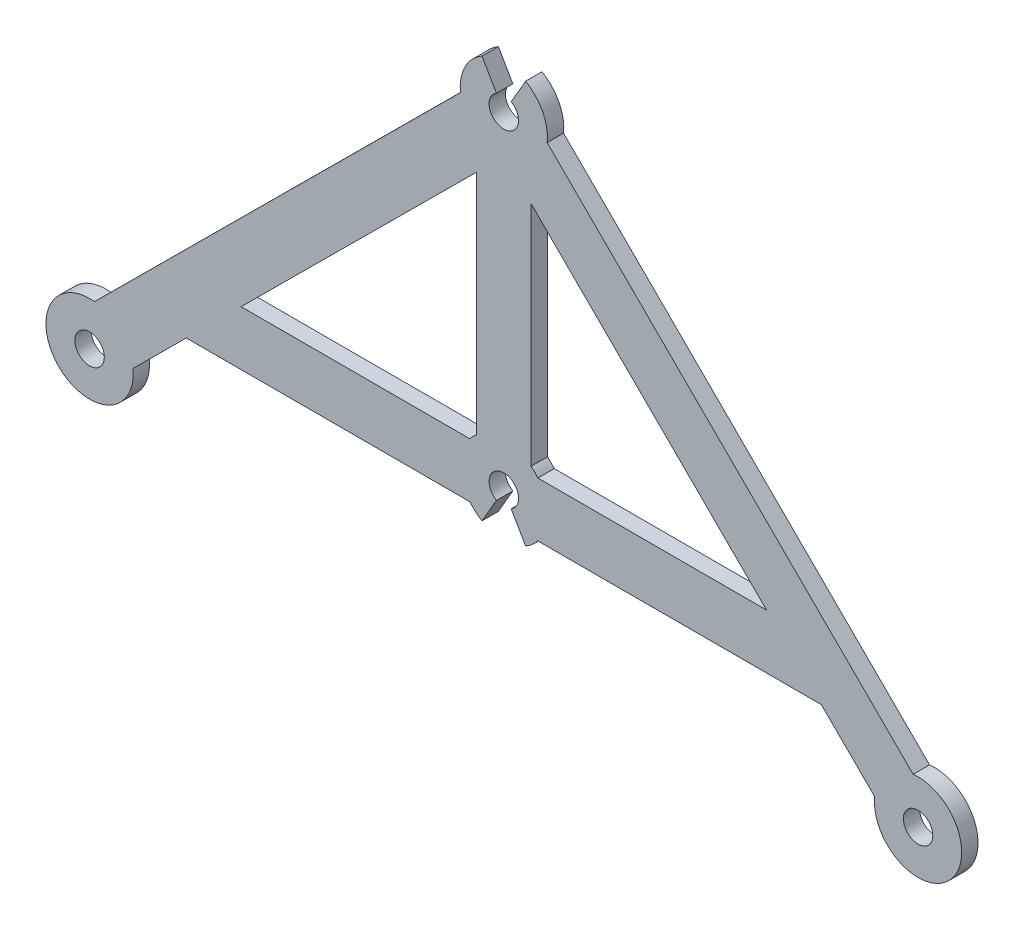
ISO-10303-21;
HEADER;
FILE_DESCRIPTION(('STEP AP214'),'2;1');
FILE_NAME('part.step','',(''),(''),'','','');
FILE_SCHEMA(('AUTOMOTIVE_DESIGN { 1 0 10303 214 1 1 1 1 }'));
ENDSEC;
DATA;
#1=APPLICATION_CONTEXT('core data for automotive mechanical design processes');
#2=APPLICATION_PROTOCOL_DEFINITION('international standard','automotive_design',2000,#1);
#3=PRODUCT_CONTEXT('',#1,'mechanical');
#4=PRODUCT('Part','Part','',(#3));
#5=PRODUCT_RELATED_PRODUCT_CATEGORY('part','',(#4));
#6=PRODUCT_DEFINITION_FORMATION('','',#4);
#7=PRODUCT_DEFINITION_CONTEXT('part definition',#1,'design');
#8=PRODUCT_DEFINITION('design','',#6,#7);
#9=PRODUCT_DEFINITION_SHAPE('','',#8);
#10=(LENGTH_UNIT() NAMED_UNIT(*) SI_UNIT(.MILLI.,.METRE.));
#11=(NAMED_UNIT(*) PLANE_ANGLE_UNIT() SI_UNIT($,.RADIAN.));
#12=(NAMED_UNIT(*) SI_UNIT($,.STERADIAN.) SOLID_ANGLE_UNIT());
#13=UNCERTAINTY_MEASURE_WITH_UNIT(LENGTH_MEASURE(1.E-05),#10,'distance_accuracy_value','');
#14=(GEOMETRIC_REPRESENTATION_CONTEXT(3) GLOBAL_UNCERTAINTY_ASSIGNED_CONTEXT((#13)) GLOBAL_UNIT_ASSIGNED_CONTEXT((#10,
#11,#12)) REPRESENTATION_CONTEXT('',''));
#15=CARTESIAN_POINT('',(0.,0.,0.));
#16=DIRECTION('',(0.,0.,1.));
#17=DIRECTION('',(1.,0.,0.));
#18=AXIS2_PLACEMENT_3D('',#15,#16,#17);
#19=CARTESIAN_POINT('',(0.,2.5,1.5));
#20=DIRECTION('',(0.,1.,0.));
#21=DIRECTION('',(-1.,0.,0.));
#22=AXIS2_PLACEMENT_3D('',#19,#20,#21);
#23=PLANE('',#22);
#24=DIRECTION('',(1.,0.,0.));
#25=VECTOR('',#24,1.);
#26=CARTESIAN_POINT('',(0.,2.5,0.));
#27=LINE('',#26,#25);
#28=CARTESIAN_POINT('',(3.1224989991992,2.5,0.));
#29=VERTEX_POINT('',#28);
#30=CARTESIAN_POINT('',(24.1006031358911,2.5,0.));
#31=VERTEX_POINT('',#30);
#32=EDGE_CURVE('E424',#29,#31,#27,.T.);
#33=ORIENTED_EDGE('',*,*,#32,.F.);
#34=DIRECTION('',(0.,0.,-1.));
#35=VECTOR('',#34,1.);
#36=CARTESIAN_POINT('',(3.1224989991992,2.5,1.5));
#37=LINE('',#36,#35);
#38=CARTESIAN_POINT('',(3.1224989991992,2.5,1.5));
#39=VERTEX_POINT('',#38);
#40=EDGE_CURVE('E11',#39,#29,#37,.T.);
#41=ORIENTED_EDGE('',*,*,#40,.F.);
#42=DIRECTION('',(1.,0.,0.));
#43=VECTOR('',#42,1.);
#44=CARTESIAN_POINT('',(0.,2.5,1.5));
#45=LINE('',#44,#43);
#46=CARTESIAN_POINT('',(24.1006031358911,2.5,1.5));
#47=VERTEX_POINT('',#46);
#48=EDGE_CURVE('E239',#39,#47,#45,.T.);
#49=ORIENTED_EDGE('',*,*,#48,.T.);
#50=DIRECTION('',(0.,0.,-1.));
#51=VECTOR('',#50,1.);
#52=CARTESIAN_POINT('',(24.1006031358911,2.5,1.5));
#53=LINE('',#52,#51);
#54=EDGE_CURVE('E149',#47,#31,#53,.T.);
#55=ORIENTED_EDGE('',*,*,#54,.T.);
#56=EDGE_LOOP('',(#33,#41,#49,#55));
#57=FACE_BOUND('',#56,.T.);
#58=ADVANCED_FACE('F41',(#57),#23,.T.);
#59=CARTESIAN_POINT('',(0.,0.,1.5));
#60=DIRECTION('',(0.,0.,-1.));
#61=DIRECTION('',(-1.,0.,0.));
#62=AXIS2_PLACEMENT_3D('',#59,#60,#61);
#63=CYLINDRICAL_SURFACE('',#62,4.);
#64=CARTESIAN_POINT('',(0.,0.,0.));
#65=DIRECTION('',(0.,0.,1.));
#66=DIRECTION('',(1.,0.,0.));
#67=AXIS2_PLACEMENT_3D('',#64,#65,#66);
#68=CIRCLE('',#67,4.);
#69=CARTESIAN_POINT('',(2.5,3.1224989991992,0.));
#70=VERTEX_POINT('',#69);
#71=EDGE_CURVE('E245',#29,#70,#68,.T.);
#72=ORIENTED_EDGE('',*,*,#71,.T.);
#73=DIRECTION('',(0.,0.,-1.));
#74=VECTOR('',#73,1.);
#75=CARTESIAN_POINT('',(2.5,3.1224989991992,1.5));
#76=LINE('',#75,#74);
#77=CARTESIAN_POINT('',(2.5,3.1224989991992,1.5));
#78=VERTEX_POINT('',#77);
#79=EDGE_CURVE('E52',#78,#70,#76,.T.);
#80=ORIENTED_EDGE('',*,*,#79,.F.);
#81=CARTESIAN_POINT('',(0.,0.,1.5));
#82=DIRECTION('',(0.,0.,1.));
#83=DIRECTION('',(1.,0.,0.));
#84=AXIS2_PLACEMENT_3D('',#81,#82,#83);
#85=CIRCLE('',#84,4.);
#86=EDGE_CURVE('E235',#39,#78,#85,.T.);
#87=ORIENTED_EDGE('',*,*,#86,.F.);
#88=ORIENTED_EDGE('',*,*,#40,.T.);
#89=EDGE_LOOP('',(#72,#80,#87,#88));
#90=FACE_BOUND('',#89,.T.);
#91=ADVANCED_FACE('F243',(#90),#63,.T.);
#92=CARTESIAN_POINT('',(2.5,0.,1.5));
#93=DIRECTION('',(-1.,0.,0.));
#94=DIRECTION('',(0.,-1.,0.));
#95=AXIS2_PLACEMENT_3D('',#92,#93,#94);
#96=PLANE('',#95);
#97=DIRECTION('',(0.,1.,0.));
#98=VECTOR('',#97,1.);
#99=CARTESIAN_POINT('',(2.5,0.,0.));
#100=LINE('',#99,#98);
#101=CARTESIAN_POINT('',(2.5,23.9869157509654,0.));
#102=VERTEX_POINT('',#101);
#103=EDGE_CURVE('E429',#70,#102,#100,.T.);
#104=ORIENTED_EDGE('',*,*,#103,.T.);
#105=DIRECTION('',(0.,0.,-1.));
#106=VECTOR('',#105,1.);
#107=CARTESIAN_POINT('',(2.5,23.9869157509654,1.5));
#108=LINE('',#107,#106);
#109=CARTESIAN_POINT('',(2.5,23.9869157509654,1.5));
#110=VERTEX_POINT('',#109);
#111=EDGE_CURVE('E233',#110,#102,#108,.T.);
#112=ORIENTED_EDGE('',*,*,#111,.F.);
#113=DIRECTION('',(0.,1.,0.));
#114=VECTOR('',#113,1.);
#115=CARTESIAN_POINT('',(2.5,0.,1.5));
#116=LINE('',#115,#114);
#117=EDGE_CURVE('E227',#78,#110,#116,.T.);
#118=ORIENTED_EDGE('',*,*,#117,.F.);
#119=ORIENTED_EDGE('',*,*,#79,.T.);
#120=EDGE_LOOP('',(#104,#112,#118,#119));
#121=FACE_BOUND('',#120,.T.);
#122=ADVANCED_FACE('F230',(#121),#96,.F.);
#123=CARTESIAN_POINT('',(16.7628876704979,16.8515801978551,1.5));
#124=DIRECTION('',(-0.705238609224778,-0.708970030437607,0.));
#125=DIRECTION('',(0.708970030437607,-0.705238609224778,0.));
#126=AXIS2_PLACEMENT_3D('',#123,#124,#125);
#127=PLANE('',#126);
#128=DIRECTION('',(-0.708970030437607,0.705238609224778,0.));
#129=VECTOR('',#128,1.);
#130=CARTESIAN_POINT('',(16.7628876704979,16.8515801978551,0.));
#131=LINE('',#130,#129);
#132=CARTESIAN_POINT('',(37.5493383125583,-3.82546807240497,0.));
#133=VERTEX_POINT('',#132);
#134=CARTESIAN_POINT('',(3.9768547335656,29.570318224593,0.));
#135=VERTEX_POINT('',#134);
#136=EDGE_CURVE('E361',#133,#135,#131,.T.);
#137=ORIENTED_EDGE('',*,*,#136,.T.);
#138=DIRECTION('',(0.,0.,-1.));
#139=VECTOR('',#138,1.);
#140=CARTESIAN_POINT('',(3.9768547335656,29.570318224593,1.5));
#141=LINE('',#140,#139);
#142=CARTESIAN_POINT('',(3.9768547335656,29.570318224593,1.5));
#143=VERTEX_POINT('',#142);
#144=EDGE_CURVE('E312',#143,#135,#141,.T.);
#145=ORIENTED_EDGE('',*,*,#144,.F.);
#146=DIRECTION('',(-0.708970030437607,0.705238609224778,0.));
#147=VECTOR('',#146,1.);
#148=CARTESIAN_POINT('',(16.7628876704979,16.8515801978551,1.5));
#149=LINE('',#148,#147);
#150=CARTESIAN_POINT('',(37.5493383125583,-3.82546807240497,1.5));
#151=VERTEX_POINT('',#150);
#152=EDGE_CURVE('E456',#151,#143,#149,.T.);
#153=ORIENTED_EDGE('',*,*,#152,.F.);
#154=DIRECTION('',(0.,0.,-1.));
#155=VECTOR('',#154,1.);
#156=CARTESIAN_POINT('',(37.5493383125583,-3.82546807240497,1.5));
#157=LINE('',#156,#155);
#158=EDGE_CURVE('E252',#151,#133,#157,.T.);
#159=ORIENTED_EDGE('',*,*,#158,.T.);
#160=EDGE_LOOP('',(#137,#145,#153,#159));
#161=FACE_BOUND('',#160,.T.);
#162=ADVANCED_FACE('F604',(#161),#127,.F.);
#163=CARTESIAN_POINT('',(0.,30.,1.5));
#164=DIRECTION('',(0.,0.,-1.));
#165=DIRECTION('',(-1.,0.,0.));
#166=AXIS2_PLACEMENT_3D('',#163,#164,#165);
#167=CYLINDRICAL_SURFACE('',#166,4.);
#168=CARTESIAN_POINT('',(0.,30.,0.));
#169=DIRECTION('',(0.,0.,1.));
#170=DIRECTION('',(1.,0.,0.));
#171=AXIS2_PLACEMENT_3D('',#168,#169,#170);
#172=CIRCLE('',#171,4.);
#173=CARTESIAN_POINT('',(2.,33.4641016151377,0.));
#174=VERTEX_POINT('',#173);
#175=EDGE_CURVE('E365',#135,#174,#172,.T.);
#176=ORIENTED_EDGE('',*,*,#175,.T.);
#177=DIRECTION('',(0.,0.,-1.));
#178=VECTOR('',#177,1.);
#179=CARTESIAN_POINT('',(2.,33.4641016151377,1.5));
#180=LINE('',#179,#178);
#181=CARTESIAN_POINT('',(2.,33.4641016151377,1.5));
#182=VERTEX_POINT('',#181);
#183=EDGE_CURVE('E309',#182,#174,#180,.T.);
#184=ORIENTED_EDGE('',*,*,#183,.F.);
#185=CARTESIAN_POINT('',(0.,30.,1.5));
#186=DIRECTION('',(0.,0.,1.));
#187=DIRECTION('',(1.,0.,0.));
#188=AXIS2_PLACEMENT_3D('',#185,#186,#187);
#189=CIRCLE('',#188,4.);
#190=EDGE_CURVE('E460',#143,#182,#189,.T.);
#191=ORIENTED_EDGE('',*,*,#190,.F.);
#192=ORIENTED_EDGE('',*,*,#144,.T.);
#193=EDGE_LOOP('',(#176,#184,#191,#192));
#194=FACE_BOUND('',#193,.T.);
#195=ADVANCED_FACE('F600',(#194),#167,.T.);
#196=CARTESIAN_POINT('',(-12.9903810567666,7.50000000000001,1.5));
#197=DIRECTION('',(-0.866025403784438,0.5,0.));
#198=DIRECTION('',(-0.5,-0.866025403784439,0.));
#199=AXIS2_PLACEMENT_3D('',#196,#197,#198);
#200=PLANE('',#199);
#201=DIRECTION('',(0.5,0.866025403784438,0.));
#202=VECTOR('',#201,1.);
#203=CARTESIAN_POINT('',(-12.9903810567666,7.50000000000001,0.));
#204=LINE('',#203,#202);
#205=CARTESIAN_POINT('',(0.674999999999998,31.169134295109,0.));
#206=VERTEX_POINT('',#205);
#207=EDGE_CURVE('E369',#206,#174,#204,.T.);
#208=ORIENTED_EDGE('',*,*,#207,.F.);
#209=DIRECTION('',(0.,0.,-1.));
#210=VECTOR('',#209,1.);
#211=CARTESIAN_POINT('',(0.674999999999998,31.169134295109,1.5));
#212=LINE('',#211,#210);
#213=CARTESIAN_POINT('',(0.674999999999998,31.169134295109,1.5));
#214=VERTEX_POINT('',#213);
#215=EDGE_CURVE('E306',#214,#206,#212,.T.);
#216=ORIENTED_EDGE('',*,*,#215,.F.);
#217=DIRECTION('',(0.5,0.866025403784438,0.));
#218=VECTOR('',#217,1.);
#219=CARTESIAN_POINT('',(-12.9903810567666,7.50000000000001,1.5));
#220=LINE('',#219,#218);
#221=EDGE_CURVE('E463',#214,#182,#220,.T.);
#222=ORIENTED_EDGE('',*,*,#221,.T.);
#223=ORIENTED_EDGE('',*,*,#183,.T.);
#224=EDGE_LOOP('',(#208,#216,#222,#223));
#225=FACE_BOUND('',#224,.T.);
#226=ADVANCED_FACE('F596',(#225),#200,.T.);
#227=CARTESIAN_POINT('',(0.,30.,1.5));
#228=DIRECTION('',(0.,0.,-1.));
#229=DIRECTION('',(-1.,0.,0.));
#230=AXIS2_PLACEMENT_3D('',#227,#228,#229);
#231=CYLINDRICAL_SURFACE('',#230,1.35);
#232=CARTESIAN_POINT('',(0.,30.,0.));
#233=DIRECTION('',(0.,0.,1.));
#234=DIRECTION('',(1.,0.,0.));
#235=AXIS2_PLACEMENT_3D('',#232,#233,#234);
#236=CIRCLE('',#235,1.35);
#237=CARTESIAN_POINT('',(-0.675,31.169134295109,0.));
#238=VERTEX_POINT('',#237);
#239=EDGE_CURVE('E373',#238,#206,#236,.T.);
#240=ORIENTED_EDGE('',*,*,#239,.F.);
#241=DIRECTION('',(0.,0.,-1.));
#242=VECTOR('',#241,1.);
#243=CARTESIAN_POINT('',(-0.675,31.169134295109,1.5));
#244=LINE('',#243,#242);
#245=CARTESIAN_POINT('',(-0.675,31.169134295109,1.5));
#246=VERTEX_POINT('',#245);
#247=EDGE_CURVE('E303',#246,#238,#244,.T.);
#248=ORIENTED_EDGE('',*,*,#247,.F.);
#249=CARTESIAN_POINT('',(0.,30.,1.5));
#250=DIRECTION('',(0.,0.,1.));
#251=DIRECTION('',(1.,0.,0.));
#252=AXIS2_PLACEMENT_3D('',#249,#250,#251);
#253=CIRCLE('',#252,1.35);
#254=EDGE_CURVE('E467',#246,#214,#253,.T.);
#255=ORIENTED_EDGE('',*,*,#254,.T.);
#256=ORIENTED_EDGE('',*,*,#215,.T.);
#257=EDGE_LOOP('',(#240,#248,#255,#256));
#258=FACE_BOUND('',#257,.T.);
#259=ADVANCED_FACE('F592',(#258),#231,.F.);
#260=CARTESIAN_POINT('',(12.9903810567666,7.50000000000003,1.5));
#261=DIRECTION('',(-0.866025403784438,-0.500000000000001,0.));
#262=DIRECTION('',(0.500000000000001,-0.866025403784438,0.));
#263=AXIS2_PLACEMENT_3D('',#260,#261,#262);
#264=PLANE('',#263);
#265=DIRECTION('',(-0.500000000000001,0.866025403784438,0.));
#266=VECTOR('',#265,1.);
#267=CARTESIAN_POINT('',(12.9903810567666,7.50000000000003,0.));
#268=LINE('',#267,#266);
#269=CARTESIAN_POINT('',(-2.,33.4641016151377,0.));
#270=VERTEX_POINT('',#269);
#271=EDGE_CURVE('E377',#238,#270,#268,.T.);
#272=ORIENTED_EDGE('',*,*,#271,.T.);
#273=DIRECTION('',(0.,0.,-1.));
#274=VECTOR('',#273,1.);
#275=CARTESIAN_POINT('',(-2.,33.4641016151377,1.5));
#276=LINE('',#275,#274);
#277=CARTESIAN_POINT('',(-2.,33.4641016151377,1.5));
#278=VERTEX_POINT('',#277);
#279=EDGE_CURVE('E299',#278,#270,#276,.T.);
#280=ORIENTED_EDGE('',*,*,#279,.F.);
#281=DIRECTION('',(-0.500000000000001,0.866025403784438,0.));
#282=VECTOR('',#281,1.);
#283=CARTESIAN_POINT('',(12.9903810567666,7.50000000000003,1.5));
#284=LINE('',#283,#282);
#285=EDGE_CURVE('E471',#246,#278,#284,.T.);
#286=ORIENTED_EDGE('',*,*,#285,.F.);
#287=ORIENTED_EDGE('',*,*,#247,.T.);
#288=EDGE_LOOP('',(#272,#280,#286,#287));
#289=FACE_BOUND('',#288,.T.);
#290=ADVANCED_FACE('F588',(#289),#264,.F.);
#291=CARTESIAN_POINT('',(0.,30.,1.5));
#292=DIRECTION('',(0.,0.,-1.));
#293=DIRECTION('',(-1.,0.,0.));
#294=AXIS2_PLACEMENT_3D('',#291,#292,#293);
#295=CYLINDRICAL_SURFACE('',#294,4.);
#296=CARTESIAN_POINT('',(0.,30.,0.));
#297=DIRECTION('',(0.,0.,1.));
#298=DIRECTION('',(1.,0.,0.));
#299=AXIS2_PLACEMENT_3D('',#296,#297,#298);
#300=CIRCLE('',#299,4.);
#301=CARTESIAN_POINT('',(-3.9768547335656,29.570318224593,0.));
#302=VERTEX_POINT('',#301);
#303=EDGE_CURVE('E380',#270,#302,#300,.T.);
#304=ORIENTED_EDGE('',*,*,#303,.T.);
#305=DIRECTION('',(0.,0.,-1.));
#306=VECTOR('',#305,1.);
#307=CARTESIAN_POINT('',(-3.9768547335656,29.570318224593,1.5));
#308=LINE('',#307,#306);
#309=CARTESIAN_POINT('',(-3.9768547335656,29.570318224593,1.5));
#310=VERTEX_POINT('',#309);
#311=EDGE_CURVE('E295',#310,#302,#308,.T.);
#312=ORIENTED_EDGE('',*,*,#311,.F.);
#313=CARTESIAN_POINT('',(0.,30.,1.5));
#314=DIRECTION('',(0.,0.,1.));
#315=DIRECTION('',(1.,0.,0.));
#316=AXIS2_PLACEMENT_3D('',#313,#314,#315);
#317=CIRCLE('',#316,4.);
#318=EDGE_CURVE('E474',#278,#310,#317,.T.);
#319=ORIENTED_EDGE('',*,*,#318,.F.);
#320=ORIENTED_EDGE('',*,*,#279,.T.);
#321=EDGE_LOOP('',(#304,#312,#319,#320));
#322=FACE_BOUND('',#321,.T.);
#323=ADVANCED_FACE('F584',(#322),#295,.T.);
#324=CARTESIAN_POINT('',(-16.7628876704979,16.8515801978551,1.5));
#325=DIRECTION('',(0.705238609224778,-0.708970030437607,0.));
#326=DIRECTION('',(0.708970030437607,0.705238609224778,0.));
#327=AXIS2_PLACEMENT_3D('',#324,#325,#326);
#328=PLANE('',#327);
#329=DIRECTION('',(-0.708970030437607,-0.705238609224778,0.));
#330=VECTOR('',#329,1.);
#331=CARTESIAN_POINT('',(-16.7628876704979,16.8515801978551,0.));
#332=LINE('',#331,#330);
#333=CARTESIAN_POINT('',(-37.5493383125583,-3.82546807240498,0.));
#334=VERTEX_POINT('',#333);
#335=EDGE_CURVE('E383',#302,#334,#332,.T.);
#336=ORIENTED_EDGE('',*,*,#335,.T.);
#337=DIRECTION('',(0.,0.,-1.));
#338=VECTOR('',#337,1.);
#339=CARTESIAN_POINT('',(-37.5493383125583,-3.82546807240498,1.5));
#340=LINE('',#339,#338);
#341=CARTESIAN_POINT('',(-37.5493383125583,-3.82546807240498,1.5));
#342=VERTEX_POINT('',#341);
#343=EDGE_CURVE('E291',#342,#334,#340,.T.);
#344=ORIENTED_EDGE('',*,*,#343,.F.);
#345=DIRECTION('',(-0.708970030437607,-0.705238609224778,0.));
#346=VECTOR('',#345,1.);
#347=CARTESIAN_POINT('',(-16.7628876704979,16.8515801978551,1.5));
#348=LINE('',#347,#346);
#349=EDGE_CURVE('E477',#310,#342,#348,.T.);
#350=ORIENTED_EDGE('',*,*,#349,.F.);
#351=ORIENTED_EDGE('',*,*,#311,.T.);
#352=EDGE_LOOP('',(#336,#344,#350,#351));
#353=FACE_BOUND('',#352,.T.);
#354=ADVANCED_FACE('F580',(#353),#328,.F.);
#355=CARTESIAN_POINT('',(-38.,-7.8,1.5));
#356=DIRECTION('',(0.,0.,-1.));
#357=DIRECTION('',(-1.,0.,0.));
#358=AXIS2_PLACEMENT_3D('',#355,#356,#357);
#359=CYLINDRICAL_SURFACE('',#358,4.);
#360=CARTESIAN_POINT('',(-38.,-7.8,0.));
#361=DIRECTION('',(0.,0.,1.));
#362=DIRECTION('',(1.,0.,0.));
#363=AXIS2_PLACEMENT_3D('',#360,#361,#362);
#364=CIRCLE('',#363,4.);
#365=CARTESIAN_POINT('',(-34.0231452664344,-7.37031822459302,0.));
#366=VERTEX_POINT('',#365);
#367=EDGE_CURVE('E386',#334,#366,#364,.T.);
#368=ORIENTED_EDGE('',*,*,#367,.T.);
#369=DIRECTION('',(0.,0.,-1.));
#370=VECTOR('',#369,1.);
#371=CARTESIAN_POINT('',(-34.0231452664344,-7.37031822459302,1.5));
#372=LINE('',#371,#370);
#373=CARTESIAN_POINT('',(-34.0231452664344,-7.37031822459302,1.5));
#374=VERTEX_POINT('',#373);
#375=EDGE_CURVE('E287',#374,#366,#372,.T.);
#376=ORIENTED_EDGE('',*,*,#375,.F.);
#377=CARTESIAN_POINT('',(-38.,-7.8,1.5));
#378=DIRECTION('',(0.,0.,1.));
#379=DIRECTION('',(1.,0.,0.));
#380=AXIS2_PLACEMENT_3D('',#377,#378,#379);
#381=CIRCLE('',#380,4.);
#382=EDGE_CURVE('E480',#342,#374,#381,.T.);
#383=ORIENTED_EDGE('',*,*,#382,.F.);
#384=ORIENTED_EDGE('',*,*,#343,.T.);
#385=EDGE_LOOP('',(#368,#376,#383,#384));
#386=FACE_BOUND('',#385,.T.);
#387=ADVANCED_FACE('F576',(#386),#359,.T.);
#388=CARTESIAN_POINT('',(-13.236694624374,13.306730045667,1.5));
#389=DIRECTION('',(-0.705238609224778,0.708970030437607,0.));
#390=DIRECTION('',(-0.708970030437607,-0.705238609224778,0.));
#391=AXIS2_PLACEMENT_3D('',#388,#389,#390);
#392=PLANE('',#391);
#393=DIRECTION('',(0.708970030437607,0.705238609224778,0.));
#394=VECTOR('',#393,1.);
#395=CARTESIAN_POINT('',(-13.236694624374,13.306730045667,0.));
#396=LINE('',#395,#394);
#397=CARTESIAN_POINT('',(-29.1270581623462,-2.5,0.));
#398=VERTEX_POINT('',#397);
#399=EDGE_CURVE('E389',#366,#398,#396,.T.);
#400=ORIENTED_EDGE('',*,*,#399,.T.);
#401=DIRECTION('',(0.,0.,-1.));
#402=VECTOR('',#401,1.);
#403=CARTESIAN_POINT('',(-29.1270581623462,-2.5,1.5));
#404=LINE('',#403,#402);
#405=CARTESIAN_POINT('',(-29.1270581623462,-2.5,1.5));
#406=VERTEX_POINT('',#405);
#407=EDGE_CURVE('E284',#406,#398,#404,.T.);
#408=ORIENTED_EDGE('',*,*,#407,.F.);
#409=DIRECTION('',(0.708970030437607,0.705238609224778,0.));
#410=VECTOR('',#409,1.);
#411=CARTESIAN_POINT('',(-13.236694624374,13.306730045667,1.5));
#412=LINE('',#411,#410);
#413=EDGE_CURVE('E483',#374,#406,#412,.T.);
#414=ORIENTED_EDGE('',*,*,#413,.F.);
#415=ORIENTED_EDGE('',*,*,#375,.T.);
#416=EDGE_LOOP('',(#400,#408,#414,#415));
#417=FACE_BOUND('',#416,.T.);
#418=ADVANCED_FACE('F572',(#417),#392,.F.);
#419=CARTESIAN_POINT('',(0.,-2.5,1.5));
#420=DIRECTION('',(0.,-1.,0.));
#421=DIRECTION('',(1.,0.,0.));
#422=AXIS2_PLACEMENT_3D('',#419,#420,#421);
#423=PLANE('',#422);
#424=DIRECTION('',(-1.,0.,0.));
#425=VECTOR('',#424,1.);
#426=CARTESIAN_POINT('',(0.,-2.5,0.));
#427=LINE('',#426,#425);
#428=CARTESIAN_POINT('',(-3.1224989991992,-2.5,0.));
#429=VERTEX_POINT('',#428);
#430=EDGE_CURVE('E393',#429,#398,#427,.T.);
#431=ORIENTED_EDGE('',*,*,#430,.F.);
#432=DIRECTION('',(0.,0.,-1.));
#433=VECTOR('',#432,1.);
#434=CARTESIAN_POINT('',(-3.1224989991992,-2.5,1.5));
#435=LINE('',#434,#433);
#436=CARTESIAN_POINT('',(-3.1224989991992,-2.5,1.5));
#437=VERTEX_POINT('',#436);
#438=EDGE_CURVE('E281',#437,#429,#435,.T.);
#439=ORIENTED_EDGE('',*,*,#438,.F.);
#440=DIRECTION('',(-1.,0.,0.));
#441=VECTOR('',#440,1.);
#442=CARTESIAN_POINT('',(0.,-2.5,1.5));
#443=LINE('',#442,#441);
#444=EDGE_CURVE('E486',#437,#406,#443,.T.);
#445=ORIENTED_EDGE('',*,*,#444,.T.);
#446=ORIENTED_EDGE('',*,*,#407,.T.);
#447=EDGE_LOOP('',(#431,#439,#445,#446));
#448=FACE_BOUND('',#447,.T.);
#449=ADVANCED_FACE('F568',(#448),#423,.T.);
#450=CARTESIAN_POINT('',(0.,0.,1.5));
#451=DIRECTION('',(0.,0.,-1.));
#452=DIRECTION('',(-1.,0.,0.));
#453=AXIS2_PLACEMENT_3D('',#450,#451,#452);
#454=CYLINDRICAL_SURFACE('',#453,4.);
#455=CARTESIAN_POINT('',(0.,0.,0.));
#456=DIRECTION('',(0.,0.,1.));
#457=DIRECTION('',(1.,0.,0.));
#458=AXIS2_PLACEMENT_3D('',#455,#456,#457);
#459=CIRCLE('',#458,4.);
#460=CARTESIAN_POINT('',(-2.,-3.46410161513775,0.));
#461=VERTEX_POINT('',#460);
#462=EDGE_CURVE('E397',#429,#461,#459,.T.);
#463=ORIENTED_EDGE('',*,*,#462,.T.);
#464=DIRECTION('',(0.,0.,-1.));
#465=VECTOR('',#464,1.);
#466=CARTESIAN_POINT('',(-2.,-3.46410161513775,1.5));
#467=LINE('',#466,#465);
#468=CARTESIAN_POINT('',(-2.,-3.46410161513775,1.5));
#469=VERTEX_POINT('',#468);
#470=EDGE_CURVE('E278',#469,#461,#467,.T.);
#471=ORIENTED_EDGE('',*,*,#470,.F.);
#472=CARTESIAN_POINT('',(0.,0.,1.5));
#473=DIRECTION('',(0.,0.,1.));
#474=DIRECTION('',(1.,0.,0.));
#475=AXIS2_PLACEMENT_3D('',#472,#473,#474);
#476=CIRCLE('',#475,4.);
#477=EDGE_CURVE('E490',#437,#469,#476,.T.);
#478=ORIENTED_EDGE('',*,*,#477,.F.);
#479=ORIENTED_EDGE('',*,*,#438,.T.);
#480=EDGE_LOOP('',(#463,#471,#478,#479));
#481=FACE_BOUND('',#480,.T.);
#482=ADVANCED_FACE('F564',(#481),#454,.T.);
#483=CARTESIAN_POINT('',(0.,0.,1.5));
#484=DIRECTION('',(0.866025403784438,-0.500000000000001,0.));
#485=DIRECTION('',(0.500000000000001,0.866025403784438,0.));
#486=AXIS2_PLACEMENT_3D('',#483,#484,#485);
#487=PLANE('',#486);
#488=DIRECTION('',(-0.500000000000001,-0.866025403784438,0.));
#489=VECTOR('',#488,1.);
#490=CARTESIAN_POINT('',(0.,0.,0.));
#491=LINE('',#490,#489);
#492=CARTESIAN_POINT('',(-0.675000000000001,-1.16913429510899,0.));
#493=VERTEX_POINT('',#492);
#494=EDGE_CURVE('E401',#493,#461,#491,.T.);
#495=ORIENTED_EDGE('',*,*,#494,.F.);
#496=DIRECTION('',(0.,0.,-1.));
#497=VECTOR('',#496,1.);
#498=CARTESIAN_POINT('',(-0.675000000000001,-1.16913429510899,1.5));
#499=LINE('',#498,#497);
#500=CARTESIAN_POINT('',(-0.675000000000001,-1.16913429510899,1.5));
#501=VERTEX_POINT('',#500);
#502=EDGE_CURVE('E275',#501,#493,#499,.T.);
#503=ORIENTED_EDGE('',*,*,#502,.F.);
#504=DIRECTION('',(-0.500000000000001,-0.866025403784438,0.));
#505=VECTOR('',#504,1.);
#506=CARTESIAN_POINT('',(0.,0.,1.5));
#507=LINE('',#506,#505);
#508=EDGE_CURVE('E493',#501,#469,#507,.T.);
#509=ORIENTED_EDGE('',*,*,#508,.T.);
#510=ORIENTED_EDGE('',*,*,#470,.T.);
#511=EDGE_LOOP('',(#495,#503,#509,#510));
#512=FACE_BOUND('',#511,.T.);
#513=ADVANCED_FACE('F560',(#512),#487,.T.);
#514=CARTESIAN_POINT('',(0.,0.,1.5));
#515=DIRECTION('',(0.,0.,-1.));
#516=DIRECTION('',(-1.,0.,0.));
#517=AXIS2_PLACEMENT_3D('',#514,#515,#516);
#518=CYLINDRICAL_SURFACE('',#517,1.35);
#519=CARTESIAN_POINT('',(0.,0.,0.));
#520=DIRECTION('',(0.,0.,1.));
#521=DIRECTION('',(1.,0.,0.));
#522=AXIS2_PLACEMENT_3D('',#519,#520,#521);
#523=CIRCLE('',#522,1.35);
#524=CARTESIAN_POINT('',(0.675000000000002,-1.16913429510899,0.));
#525=VERTEX_POINT('',#524);
#526=EDGE_CURVE('E405',#525,#493,#523,.T.);
#527=ORIENTED_EDGE('',*,*,#526,.F.);
#528=DIRECTION('',(0.,0.,-1.));
#529=VECTOR('',#528,1.);
#530=CARTESIAN_POINT('',(0.675000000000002,-1.16913429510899,1.5));
#531=LINE('',#530,#529);
#532=CARTESIAN_POINT('',(0.675000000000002,-1.16913429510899,1.5));
#533=VERTEX_POINT('',#532);
#534=EDGE_CURVE('E272',#533,#525,#531,.T.);
#535=ORIENTED_EDGE('',*,*,#534,.F.);
#536=CARTESIAN_POINT('',(0.,0.,1.5));
#537=DIRECTION('',(0.,0.,1.));
#538=DIRECTION('',(1.,0.,0.));
#539=AXIS2_PLACEMENT_3D('',#536,#537,#538);
#540=CIRCLE('',#539,1.35);
#541=EDGE_CURVE('E497',#533,#501,#540,.T.);
#542=ORIENTED_EDGE('',*,*,#541,.T.);
#543=ORIENTED_EDGE('',*,*,#502,.T.);
#544=EDGE_LOOP('',(#527,#535,#542,#543));
#545=FACE_BOUND('',#544,.T.);
#546=ADVANCED_FACE('F556',(#545),#518,.F.);
#547=CARTESIAN_POINT('',(0.,0.,1.5));
#548=DIRECTION('',(0.866025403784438,0.500000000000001,0.));
#549=DIRECTION('',(-0.500000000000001,0.866025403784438,0.));
#550=AXIS2_PLACEMENT_3D('',#547,#548,#549);
#551=PLANE('',#550);
#552=DIRECTION('',(0.500000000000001,-0.866025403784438,0.));
#553=VECTOR('',#552,1.);
#554=CARTESIAN_POINT('',(0.,0.,0.));
#555=LINE('',#554,#553);
#556=CARTESIAN_POINT('',(2.,-3.46410161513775,0.));
#557=VERTEX_POINT('',#556);
#558=EDGE_CURVE('E409',#525,#557,#555,.T.);
#559=ORIENTED_EDGE('',*,*,#558,.T.);
#560=DIRECTION('',(0.,0.,-1.));
#561=VECTOR('',#560,1.);
#562=CARTESIAN_POINT('',(2.,-3.46410161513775,1.5));
#563=LINE('',#562,#561);
#564=CARTESIAN_POINT('',(2.,-3.46410161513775,1.5));
#565=VERTEX_POINT('',#564);
#566=EDGE_CURVE('E268',#565,#557,#563,.T.);
#567=ORIENTED_EDGE('',*,*,#566,.F.);
#568=DIRECTION('',(0.500000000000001,-0.866025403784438,0.));
#569=VECTOR('',#568,1.);
#570=CARTESIAN_POINT('',(0.,0.,1.5));
#571=LINE('',#570,#569);
#572=EDGE_CURVE('E501',#533,#565,#571,.T.);
#573=ORIENTED_EDGE('',*,*,#572,.F.);
#574=ORIENTED_EDGE('',*,*,#534,.T.);
#575=EDGE_LOOP('',(#559,#567,#573,#574));
#576=FACE_BOUND('',#575,.T.);
#577=ADVANCED_FACE('F552',(#576),#551,.F.);
#578=CARTESIAN_POINT('',(0.,0.,1.5));
#579=DIRECTION('',(0.,0.,-1.));
#580=DIRECTION('',(-1.,0.,0.));
#581=AXIS2_PLACEMENT_3D('',#578,#579,#580);
#582=CYLINDRICAL_SURFACE('',#581,4.);
#583=CARTESIAN_POINT('',(0.,0.,0.));
#584=DIRECTION('',(0.,0.,1.));
#585=DIRECTION('',(1.,0.,0.));
#586=AXIS2_PLACEMENT_3D('',#583,#584,#585);
#587=CIRCLE('',#586,4.);
#588=CARTESIAN_POINT('',(3.1224989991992,-2.5,0.));
#589=VERTEX_POINT('',#588);
#590=EDGE_CURVE('E412',#557,#589,#587,.T.);
#591=ORIENTED_EDGE('',*,*,#590,.T.);
#592=DIRECTION('',(0.,0.,-1.));
#593=VECTOR('',#592,1.);
#594=CARTESIAN_POINT('',(3.1224989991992,-2.5,1.5));
#595=LINE('',#594,#593);
#596=CARTESIAN_POINT('',(3.1224989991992,-2.5,1.5));
#597=VERTEX_POINT('',#596);
#598=EDGE_CURVE('E264',#597,#589,#595,.T.);
#599=ORIENTED_EDGE('',*,*,#598,.F.);
#600=CARTESIAN_POINT('',(0.,0.,1.5));
#601=DIRECTION('',(0.,0.,1.));
#602=DIRECTION('',(1.,0.,0.));
#603=AXIS2_PLACEMENT_3D('',#600,#601,#602);
#604=CIRCLE('',#603,4.);
#605=EDGE_CURVE('E504',#565,#597,#604,.T.);
#606=ORIENTED_EDGE('',*,*,#605,.F.);
#607=ORIENTED_EDGE('',*,*,#566,.T.);
#608=EDGE_LOOP('',(#591,#599,#606,#607));
#609=FACE_BOUND('',#608,.T.);
#610=ADVANCED_FACE('F548',(#609),#582,.T.);
#611=CARTESIAN_POINT('',(0.,-2.5,1.5));
#612=DIRECTION('',(0.,1.,0.));
#613=DIRECTION('',(-1.,0.,0.));
#614=AXIS2_PLACEMENT_3D('',#611,#612,#613);
#615=PLANE('',#614);
#616=DIRECTION('',(1.,0.,0.));
#617=VECTOR('',#616,1.);
#618=CARTESIAN_POINT('',(0.,-2.5,0.));
#619=LINE('',#618,#617);
#620=CARTESIAN_POINT('',(29.1270581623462,-2.49999999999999,0.));
#621=VERTEX_POINT('',#620);
#622=EDGE_CURVE('E415',#589,#621,#619,.T.);
#623=ORIENTED_EDGE('',*,*,#622,.T.);
#624=DIRECTION('',(0.,0.,-1.));
#625=VECTOR('',#624,1.);
#626=CARTESIAN_POINT('',(29.1270581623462,-2.49999999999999,1.5));
#627=LINE('',#626,#625);
#628=CARTESIAN_POINT('',(29.1270581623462,-2.49999999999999,1.5));
#629=VERTEX_POINT('',#628);
#630=EDGE_CURVE('E260',#629,#621,#627,.T.);
#631=ORIENTED_EDGE('',*,*,#630,.F.);
#632=DIRECTION('',(1.,0.,0.));
#633=VECTOR('',#632,1.);
#634=CARTESIAN_POINT('',(0.,-2.5,1.5));
#635=LINE('',#634,#633);
#636=EDGE_CURVE('E507',#597,#629,#635,.T.);
#637=ORIENTED_EDGE('',*,*,#636,.F.);
#638=ORIENTED_EDGE('',*,*,#598,.T.);
#639=EDGE_LOOP('',(#623,#631,#637,#638));
#640=FACE_BOUND('',#639,.T.);
#641=ADVANCED_FACE('F544',(#640),#615,.F.);
#642=CARTESIAN_POINT('',(13.236694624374,13.306730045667,1.5));
#643=DIRECTION('',(0.705238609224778,0.708970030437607,0.));
#644=DIRECTION('',(-0.708970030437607,0.705238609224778,0.));
#645=AXIS2_PLACEMENT_3D('',#642,#643,#644);
#646=PLANE('',#645);
#647=DIRECTION('',(0.708970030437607,-0.705238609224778,0.));
#648=VECTOR('',#647,1.);
#649=CARTESIAN_POINT('',(13.236694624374,13.306730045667,0.));
#650=LINE('',#649,#648);
#651=CARTESIAN_POINT('',(34.0231452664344,-7.37031822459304,0.));
#652=VERTEX_POINT('',#651);
#653=EDGE_CURVE('E418',#621,#652,#650,.T.);
#654=ORIENTED_EDGE('',*,*,#653,.T.);
#655=DIRECTION('',(0.,0.,-1.));
#656=VECTOR('',#655,1.);
#657=CARTESIAN_POINT('',(34.0231452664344,-7.37031822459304,1.5));
#658=LINE('',#657,#656);
#659=CARTESIAN_POINT('',(34.0231452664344,-7.37031822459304,1.5));
#660=VERTEX_POINT('',#659);
#661=EDGE_CURVE('E256',#660,#652,#658,.T.);
#662=ORIENTED_EDGE('',*,*,#661,.F.);
#663=DIRECTION('',(0.708970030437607,-0.705238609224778,0.));
#664=VECTOR('',#663,1.);
#665=CARTESIAN_POINT('',(13.236694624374,13.306730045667,1.5));
#666=LINE('',#665,#664);
#667=EDGE_CURVE('E510',#629,#660,#666,.T.);
#668=ORIENTED_EDGE('',*,*,#667,.F.);
#669=ORIENTED_EDGE('',*,*,#630,.T.);
#670=EDGE_LOOP('',(#654,#662,#668,#669));
#671=FACE_BOUND('',#670,.T.);
#672=ADVANCED_FACE('F541',(#671),#646,.F.);
#673=CARTESIAN_POINT('',(-2.5,0.,1.5));
#674=DIRECTION('',(1.,0.,0.));
#675=DIRECTION('',(0.,1.,0.));
#676=AXIS2_PLACEMENT_3D('',#673,#674,#675);
#677=PLANE('',#676);
#678=DIRECTION('',(0.,-1.,0.));
#679=VECTOR('',#678,1.);
#680=CARTESIAN_POINT('',(-2.5,0.,0.));
#681=LINE('',#680,#679);
#682=CARTESIAN_POINT('',(-2.5,23.9869157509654,0.));
#683=VERTEX_POINT('',#682);
#684=CARTESIAN_POINT('',(-2.5,3.1224989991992,0.));
#685=VERTEX_POINT('',#684);
#686=EDGE_CURVE('E337',#683,#685,#681,.T.);
#687=ORIENTED_EDGE('',*,*,#686,.T.);
#688=DIRECTION('',(0.,0.,-1.));
#689=VECTOR('',#688,1.);
#690=CARTESIAN_POINT('',(-2.5,3.1224989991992,1.5));
#691=LINE('',#690,#689);
#692=CARTESIAN_POINT('',(-2.5,3.1224989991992,1.5));
#693=VERTEX_POINT('',#692);
#694=EDGE_CURVE('E45',#693,#685,#691,.T.);
#695=ORIENTED_EDGE('',*,*,#694,.F.);
#696=DIRECTION('',(0.,-1.,0.));
#697=VECTOR('',#696,1.);
#698=CARTESIAN_POINT('',(-2.5,0.,1.5));
#699=LINE('',#698,#697);
#700=CARTESIAN_POINT('',(-2.5,23.9869157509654,1.5));
#701=VERTEX_POINT('',#700);
#702=EDGE_CURVE('E433',#701,#693,#699,.T.);
#703=ORIENTED_EDGE('',*,*,#702,.F.);
#704=DIRECTION('',(0.,0.,-1.));
#705=VECTOR('',#704,1.);
#706=CARTESIAN_POINT('',(-2.5,23.9869157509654,1.5));
#707=LINE('',#706,#705);
#708=EDGE_CURVE('E316',#701,#683,#707,.T.);
#709=ORIENTED_EDGE('',*,*,#708,.T.);
#710=EDGE_LOOP('',(#687,#695,#703,#709));
#711=FACE_BOUND('',#710,.T.);
#712=ADVANCED_FACE('F43',(#711),#677,.F.);
#713=CARTESIAN_POINT('',(0.,0.,1.5));
#714=DIRECTION('',(0.,0.,-1.));
#715=DIRECTION('',(-1.,0.,0.));
#716=AXIS2_PLACEMENT_3D('',#713,#714,#715);
#717=CYLINDRICAL_SURFACE('',#716,4.);
#718=CARTESIAN_POINT('',(0.,0.,0.));
#719=DIRECTION('',(0.,0.,1.));
#720=DIRECTION('',(1.,0.,0.));
#721=AXIS2_PLACEMENT_3D('',#718,#719,#720);
#722=CIRCLE('',#721,4.);
#723=CARTESIAN_POINT('',(-3.1224989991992,2.5,0.));
#724=VERTEX_POINT('',#723);
#725=EDGE_CURVE('E333',#685,#724,#722,.T.);
#726=ORIENTED_EDGE('',*,*,#725,.T.);
#727=DIRECTION('',(0.,0.,-1.));
#728=VECTOR('',#727,1.);
#729=CARTESIAN_POINT('',(-3.1224989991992,2.5,1.5));
#730=LINE('',#729,#728);
#731=CARTESIAN_POINT('',(-3.1224989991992,2.5,1.5));
#732=VERTEX_POINT('',#731);
#733=EDGE_CURVE('E323',#732,#724,#730,.T.);
#734=ORIENTED_EDGE('',*,*,#733,.F.);
#735=CARTESIAN_POINT('',(0.,0.,1.5));
#736=DIRECTION('',(0.,0.,1.));
#737=DIRECTION('',(1.,0.,0.));
#738=AXIS2_PLACEMENT_3D('',#735,#736,#737);
#739=CIRCLE('',#738,4.);
#740=EDGE_CURVE('E157',#693,#732,#739,.T.);
#741=ORIENTED_EDGE('',*,*,#740,.F.);
#742=ORIENTED_EDGE('',*,*,#694,.T.);
#743=EDGE_LOOP('',(#726,#734,#741,#742));
#744=FACE_BOUND('',#743,.T.);
#745=ADVANCED_FACE('F332',(#744),#717,.T.);
#746=CARTESIAN_POINT('',(0.,2.5,1.5));
#747=DIRECTION('',(0.,-1.,0.));
#748=DIRECTION('',(1.,0.,0.));
#749=AXIS2_PLACEMENT_3D('',#746,#747,#748);
#750=PLANE('',#749);
#751=DIRECTION('',(-1.,0.,0.));
#752=VECTOR('',#751,1.);
#753=CARTESIAN_POINT('',(0.,2.5,0.));
#754=LINE('',#753,#752);
#755=CARTESIAN_POINT('',(-24.1006031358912,2.5,0.));
#756=VERTEX_POINT('',#755);
#757=EDGE_CURVE('E344',#724,#756,#754,.T.);
#758=ORIENTED_EDGE('',*,*,#757,.T.);
#759=DIRECTION('',(0.,0.,-1.));
#760=VECTOR('',#759,1.);
#761=CARTESIAN_POINT('',(-24.1006031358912,2.5,1.5));
#762=LINE('',#761,#760);
#763=CARTESIAN_POINT('',(-24.1006031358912,2.5,1.5));
#764=VERTEX_POINT('',#763);
#765=EDGE_CURVE('E320',#764,#756,#762,.T.);
#766=ORIENTED_EDGE('',*,*,#765,.F.);
#767=DIRECTION('',(-1.,0.,0.));
#768=VECTOR('',#767,1.);
#769=CARTESIAN_POINT('',(0.,2.5,1.5));
#770=LINE('',#769,#768);
#771=EDGE_CURVE('E440',#732,#764,#770,.T.);
#772=ORIENTED_EDGE('',*,*,#771,.F.);
#773=ORIENTED_EDGE('',*,*,#733,.T.);
#774=EDGE_LOOP('',(#758,#766,#772,#773));
#775=FACE_BOUND('',#774,.T.);
#776=ADVANCED_FACE('F539',(#775),#750,.F.);
#777=CARTESIAN_POINT('',(38.,-7.8,1.5));
#778=DIRECTION('',(0.,0.,-1.));
#779=DIRECTION('',(-1.,0.,0.));
#780=AXIS2_PLACEMENT_3D('',#777,#778,#779);
#781=CYLINDRICAL_SURFACE('',#780,4.);
#782=CARTESIAN_POINT('',(38.,-7.8,0.));
#783=DIRECTION('',(0.,0.,1.));
#784=DIRECTION('',(1.,0.,0.));
#785=AXIS2_PLACEMENT_3D('',#782,#783,#784);
#786=CIRCLE('',#785,4.);
#787=EDGE_CURVE('E421',#652,#133,#786,.T.);
#788=ORIENTED_EDGE('',*,*,#787,.T.);
#789=ORIENTED_EDGE('',*,*,#158,.F.);
#790=CARTESIAN_POINT('',(38.,-7.8,1.5));
#791=DIRECTION('',(0.,0.,1.));
#792=DIRECTION('',(1.,0.,0.));
#793=AXIS2_PLACEMENT_3D('',#790,#791,#792);
#794=CIRCLE('',#793,4.);
#795=EDGE_CURVE('E513',#660,#151,#794,.T.);
#796=ORIENTED_EDGE('',*,*,#795,.F.);
#797=ORIENTED_EDGE('',*,*,#661,.T.);
#798=EDGE_LOOP('',(#788,#789,#796,#797));
#799=FACE_BOUND('',#798,.T.);
#800=ADVANCED_FACE('F535',(#799),#781,.T.);
#801=CARTESIAN_POINT('',(38.,-7.8,1.5));
#802=DIRECTION('',(0.,0.,-1.));
#803=DIRECTION('',(-1.,0.,0.));
#804=AXIS2_PLACEMENT_3D('',#801,#802,#803);
#805=CYLINDRICAL_SURFACE('',#804,1.35);
#806=CARTESIAN_POINT('',(38.,-7.8,1.5));
#807=DIRECTION('',(0.,0.,1.));
#808=DIRECTION('',(1.,0.,0.));
#809=AXIS2_PLACEMENT_3D('',#806,#807,#808);
#810=CIRCLE('',#809,1.35);
#811=CARTESIAN_POINT('',(39.35,-7.8,1.5));
#812=VERTEX_POINT('',#811);
#813=EDGE_CURVE('E452',#812,#812,#810,.T.);
#814=ORIENTED_EDGE('',*,*,#813,.T.);
#815=EDGE_LOOP('',(#814));
#816=FACE_BOUND('',#815,.T.);
#817=CARTESIAN_POINT('',(38.,-7.8,0.));
#818=DIRECTION('',(0.,0.,1.));
#819=DIRECTION('',(1.,0.,0.));
#820=AXIS2_PLACEMENT_3D('',#817,#818,#819);
#821=CIRCLE('',#820,1.35);
#822=CARTESIAN_POINT('',(39.35,-7.8,0.));
#823=VERTEX_POINT('',#822);
#824=EDGE_CURVE('E357',#823,#823,#821,.T.);
#825=ORIENTED_EDGE('',*,*,#824,.F.);
#826=EDGE_LOOP('',(#825));
#827=FACE_BOUND('',#826,.T.);
#828=ADVANCED_FACE('F538',(#816,#827),#805,.F.);
#829=CARTESIAN_POINT('',(-38.,-7.8,1.5));
#830=DIRECTION('',(0.,0.,-1.));
#831=DIRECTION('',(-1.,0.,0.));
#832=AXIS2_PLACEMENT_3D('',#829,#830,#831);
#833=CYLINDRICAL_SURFACE('',#832,1.35);
#834=CARTESIAN_POINT('',(-38.,-7.8,1.5));
#835=DIRECTION('',(0.,0.,1.));
#836=DIRECTION('',(1.,0.,0.));
#837=AXIS2_PLACEMENT_3D('',#834,#835,#836);
#838=CIRCLE('',#837,1.35);
#839=CARTESIAN_POINT('',(-36.65,-7.8,1.5));
#840=VERTEX_POINT('',#839);
#841=EDGE_CURVE('E448',#840,#840,#838,.T.);
#842=ORIENTED_EDGE('',*,*,#841,.T.);
#843=EDGE_LOOP('',(#842));
#844=FACE_BOUND('',#843,.T.);
#845=CARTESIAN_POINT('',(-38.,-7.8,0.));
#846=DIRECTION('',(0.,0.,1.));
#847=DIRECTION('',(1.,0.,0.));
#848=AXIS2_PLACEMENT_3D('',#845,#846,#847);
#849=CIRCLE('',#848,1.35);
#850=CARTESIAN_POINT('',(-36.65,-7.8,0.));
#851=VERTEX_POINT('',#850);
#852=EDGE_CURVE('E353',#851,#851,#849,.T.);
#853=ORIENTED_EDGE('',*,*,#852,.F.);
#854=EDGE_LOOP('',(#853));
#855=FACE_BOUND('',#854,.T.);
#856=ADVANCED_FACE('F611',(#844,#855),#833,.F.);
#857=CARTESIAN_POINT('',(-13.2366946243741,13.306730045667,1.5));
#858=DIRECTION('',(-0.705238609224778,0.708970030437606,0.));
#859=DIRECTION('',(-0.708970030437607,-0.705238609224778,0.));
#860=AXIS2_PLACEMENT_3D('',#857,#858,#859);
#861=PLANE('',#860);
#862=DIRECTION('',(0.708970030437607,0.705238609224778,0.));
#863=VECTOR('',#862,1.);
#864=CARTESIAN_POINT('',(-13.2366946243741,13.306730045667,0.));
#865=LINE('',#864,#863);
#866=EDGE_CURVE('E350',#756,#683,#865,.T.);
#867=ORIENTED_EDGE('',*,*,#866,.T.);
#868=ORIENTED_EDGE('',*,*,#708,.F.);
#869=DIRECTION('',(0.708970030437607,0.705238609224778,0.));
#870=VECTOR('',#869,1.);
#871=CARTESIAN_POINT('',(-13.2366946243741,13.306730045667,1.5));
#872=LINE('',#871,#870);
#873=EDGE_CURVE('E445',#764,#701,#872,.T.);
#874=ORIENTED_EDGE('',*,*,#873,.F.);
#875=ORIENTED_EDGE('',*,*,#765,.T.);
#876=EDGE_LOOP('',(#867,#868,#874,#875));
#877=FACE_BOUND('',#876,.T.);
#878=ADVANCED_FACE('F615',(#877),#861,.F.);
#879=CARTESIAN_POINT('',(13.236694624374,13.306730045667,1.5));
#880=DIRECTION('',(0.705238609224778,0.708970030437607,0.));
#881=DIRECTION('',(-0.708970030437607,0.705238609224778,0.));
#882=AXIS2_PLACEMENT_3D('',#879,#880,#881);
#883=PLANE('',#882);
#884=DIRECTION('',(0.708970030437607,-0.705238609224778,0.));
#885=VECTOR('',#884,1.);
#886=CARTESIAN_POINT('',(13.236694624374,13.306730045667,0.));
#887=LINE('',#886,#885);
#888=EDGE_CURVE('E142',#102,#31,#887,.T.);
#889=ORIENTED_EDGE('',*,*,#888,.T.);
#890=ORIENTED_EDGE('',*,*,#54,.F.);
#891=DIRECTION('',(0.708970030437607,-0.705238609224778,0.));
#892=VECTOR('',#891,1.);
#893=CARTESIAN_POINT('',(13.236694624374,13.306730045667,1.5));
#894=LINE('',#893,#892);
#895=EDGE_CURVE('E61',#110,#47,#894,.T.);
#896=ORIENTED_EDGE('',*,*,#895,.F.);
#897=ORIENTED_EDGE('',*,*,#111,.T.);
#898=EDGE_LOOP('',(#889,#890,#896,#897));
#899=FACE_BOUND('',#898,.T.);
#900=ADVANCED_FACE('F523',(#899),#883,.F.);
#901=CARTESIAN_POINT('',(0.,0.,1.5));
#902=DIRECTION('',(0.,0.,1.));
#903=DIRECTION('',(1.,0.,0.));
#904=AXIS2_PLACEMENT_3D('',#901,#902,#903);
#905=PLANE('',#904);
#906=ORIENTED_EDGE('',*,*,#702,.T.);
#907=ORIENTED_EDGE('',*,*,#740,.T.);
#908=ORIENTED_EDGE('',*,*,#771,.T.);
#909=ORIENTED_EDGE('',*,*,#873,.T.);
#910=EDGE_LOOP('',(#906,#907,#908,#909));
#911=FACE_BOUND('',#910,.T.);
#912=ORIENTED_EDGE('',*,*,#841,.F.);
#913=EDGE_LOOP('',(#912));
#914=FACE_BOUND('',#913,.T.);
#915=ORIENTED_EDGE('',*,*,#813,.F.);
#916=EDGE_LOOP('',(#915));
#917=FACE_BOUND('',#916,.T.);
#918=ORIENTED_EDGE('',*,*,#152,.T.);
#919=ORIENTED_EDGE('',*,*,#190,.T.);
#920=ORIENTED_EDGE('',*,*,#221,.F.);
#921=ORIENTED_EDGE('',*,*,#254,.F.);
#922=ORIENTED_EDGE('',*,*,#285,.T.);
#923=ORIENTED_EDGE('',*,*,#318,.T.);
#924=ORIENTED_EDGE('',*,*,#349,.T.);
#925=ORIENTED_EDGE('',*,*,#382,.T.);
#926=ORIENTED_EDGE('',*,*,#413,.T.);
#927=ORIENTED_EDGE('',*,*,#444,.F.);
#928=ORIENTED_EDGE('',*,*,#477,.T.);
#929=ORIENTED_EDGE('',*,*,#508,.F.);
#930=ORIENTED_EDGE('',*,*,#541,.F.);
#931=ORIENTED_EDGE('',*,*,#572,.T.);
#932=ORIENTED_EDGE('',*,*,#605,.T.);
#933=ORIENTED_EDGE('',*,*,#636,.T.);
#934=ORIENTED_EDGE('',*,*,#667,.T.);
#935=ORIENTED_EDGE('',*,*,#795,.T.);
#936=EDGE_LOOP('',(#918,#919,#920,#921,#922,#923,#924,#925,#926,#927,#928,#929,#930,#931,#932,
#933,#934,#935));
#937=FACE_BOUND('',#936,.T.);
#938=ORIENTED_EDGE('',*,*,#48,.F.);
#939=ORIENTED_EDGE('',*,*,#86,.T.);
#940=ORIENTED_EDGE('',*,*,#117,.T.);
#941=ORIENTED_EDGE('',*,*,#895,.T.);
#942=EDGE_LOOP('',(#938,#939,#940,#941));
#943=FACE_BOUND('',#942,.T.);
#944=ADVANCED_FACE('F238',(#911,#914,#917,#937,#943),#905,.T.);
#945=CARTESIAN_POINT('',(0.,0.,0.));
#946=DIRECTION('',(0.,0.,1.));
#947=DIRECTION('',(1.,0.,0.));
#948=AXIS2_PLACEMENT_3D('',#945,#946,#947);
#949=PLANE('',#948);
#950=ORIENTED_EDGE('',*,*,#686,.F.);
#951=ORIENTED_EDGE('',*,*,#866,.F.);
#952=ORIENTED_EDGE('',*,*,#757,.F.);
#953=ORIENTED_EDGE('',*,*,#725,.F.);
#954=EDGE_LOOP('',(#950,#951,#952,#953));
#955=FACE_BOUND('',#954,.T.);
#956=ORIENTED_EDGE('',*,*,#852,.T.);
#957=EDGE_LOOP('',(#956));
#958=FACE_BOUND('',#957,.T.);
#959=ORIENTED_EDGE('',*,*,#824,.T.);
#960=EDGE_LOOP('',(#959));
#961=FACE_BOUND('',#960,.T.);
#962=ORIENTED_EDGE('',*,*,#136,.F.);
#963=ORIENTED_EDGE('',*,*,#787,.F.);
#964=ORIENTED_EDGE('',*,*,#653,.F.);
#965=ORIENTED_EDGE('',*,*,#622,.F.);
#966=ORIENTED_EDGE('',*,*,#590,.F.);
#967=ORIENTED_EDGE('',*,*,#558,.F.);
#968=ORIENTED_EDGE('',*,*,#526,.T.);
#969=ORIENTED_EDGE('',*,*,#494,.T.);
#970=ORIENTED_EDGE('',*,*,#462,.F.);
#971=ORIENTED_EDGE('',*,*,#430,.T.);
#972=ORIENTED_EDGE('',*,*,#399,.F.);
#973=ORIENTED_EDGE('',*,*,#367,.F.);
#974=ORIENTED_EDGE('',*,*,#335,.F.);
#975=ORIENTED_EDGE('',*,*,#303,.F.);
#976=ORIENTED_EDGE('',*,*,#271,.F.);
#977=ORIENTED_EDGE('',*,*,#239,.T.);
#978=ORIENTED_EDGE('',*,*,#207,.T.);
#979=ORIENTED_EDGE('',*,*,#175,.F.);
#980=EDGE_LOOP('',(#962,#963,#964,#965,#966,#967,#968,#969,#970,#971,#972,#973,#974,#975,#976,
#977,#978,#979));
#981=FACE_BOUND('',#980,.T.);
#982=ORIENTED_EDGE('',*,*,#32,.T.);
#983=ORIENTED_EDGE('',*,*,#888,.F.);
#984=ORIENTED_EDGE('',*,*,#103,.F.);
#985=ORIENTED_EDGE('',*,*,#71,.F.);
#986=EDGE_LOOP('',(#982,#983,#984,#985));
#987=FACE_BOUND('',#986,.T.);
#988=ADVANCED_FACE('F517',(#955,#958,#961,#981,#987),#949,.F.);
#989=CLOSED_SHELL('',(#58,#91,#122,#162,#195,#226,#259,#290,#323,#354,#387,#418,#449,#482,#513,
#546,#577,#610,#641,#672,#712,#745,#776,#800,#828,#856,#878,#900,#944,#988));
#990=MANIFOLD_SOLID_BREP('B2',#989);
#991=ADVANCED_BREP_SHAPE_REPRESENTATION('',(#18,#990),#14);
#992=SHAPE_DEFINITION_REPRESENTATION(#9,#991);
ENDSEC;
END-ISO-10303-21;
